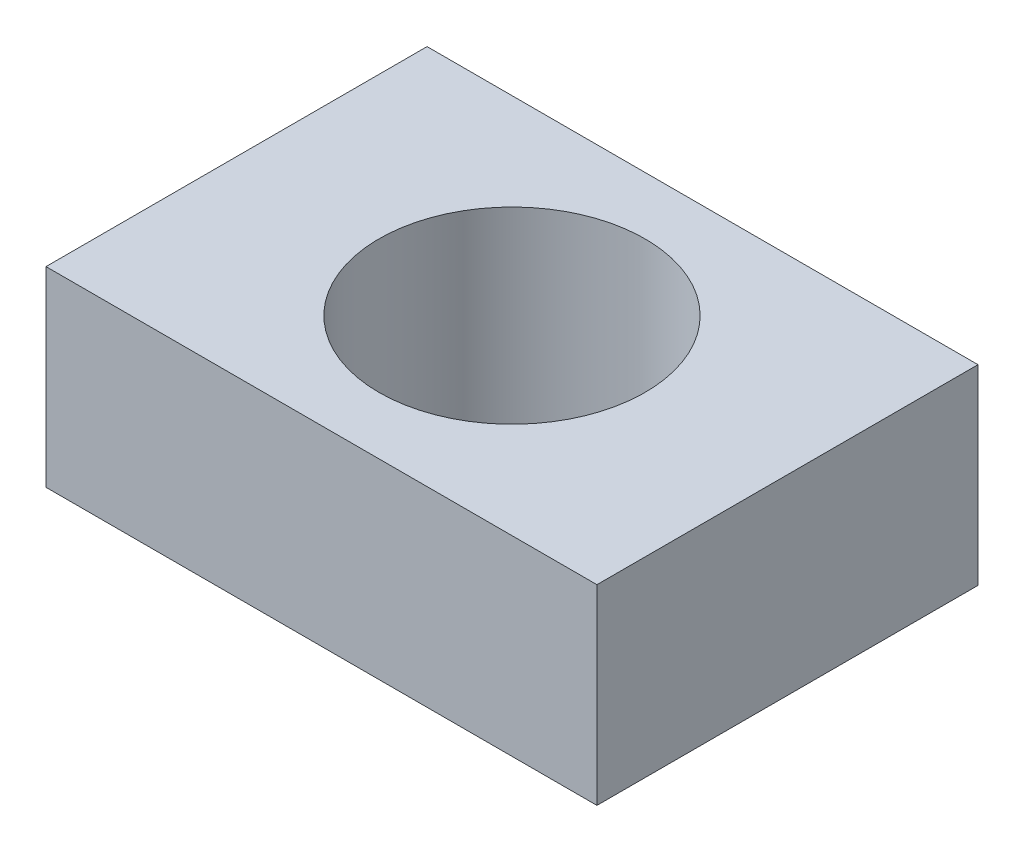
ISO-10303-21;
HEADER;
FILE_DESCRIPTION(('STEP AP214'),'2;1');
FILE_NAME('part.step','',(''),(''),'','','');
FILE_SCHEMA(('AUTOMOTIVE_DESIGN { 1 0 10303 214 1 1 1 1 }'));
ENDSEC;
DATA;
#1=APPLICATION_CONTEXT('core data for automotive mechanical design processes');
#2=APPLICATION_PROTOCOL_DEFINITION('international standard','automotive_design',2000,#1);
#3=PRODUCT_CONTEXT('',#1,'mechanical');
#4=PRODUCT('Part','Part','',(#3));
#5=PRODUCT_RELATED_PRODUCT_CATEGORY('part','',(#4));
#6=PRODUCT_DEFINITION_FORMATION('','',#4);
#7=PRODUCT_DEFINITION_CONTEXT('part definition',#1,'design');
#8=PRODUCT_DEFINITION('design','',#6,#7);
#9=PRODUCT_DEFINITION_SHAPE('','',#8);
#10=(LENGTH_UNIT() NAMED_UNIT(*) SI_UNIT(.MILLI.,.METRE.));
#11=(NAMED_UNIT(*) PLANE_ANGLE_UNIT() SI_UNIT($,.RADIAN.));
#12=(NAMED_UNIT(*) SI_UNIT($,.STERADIAN.) SOLID_ANGLE_UNIT());
#13=UNCERTAINTY_MEASURE_WITH_UNIT(LENGTH_MEASURE(1.E-05),#10,'distance_accuracy_value','');
#14=(GEOMETRIC_REPRESENTATION_CONTEXT(3) GLOBAL_UNCERTAINTY_ASSIGNED_CONTEXT((#13)) GLOBAL_UNIT_ASSIGNED_CONTEXT((#10,
#11,#12)) REPRESENTATION_CONTEXT('',''));
#15=CARTESIAN_POINT('',(0.,0.,0.));
#16=DIRECTION('',(0.,0.,1.));
#17=DIRECTION('',(1.,0.,0.));
#18=AXIS2_PLACEMENT_3D('',#15,#16,#17);
#19=CARTESIAN_POINT('',(0.,58.,0.));
#20=DIRECTION('',(0.,1.,0.));
#21=DIRECTION('',(0.,0.,1.));
#22=AXIS2_PLACEMENT_3D('',#19,#20,#21);
#23=PLANE('',#22);
#24=DIRECTION('',(0.,0.,-1.));
#25=VECTOR('',#24,1.);
#26=CARTESIAN_POINT('',(83.5746487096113,58.,-57.8053965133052));
#27=LINE('',#26,#25);
#28=CARTESIAN_POINT('',(83.5746487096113,58.,57.8053965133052));
#29=VERTEX_POINT('',#28);
#30=CARTESIAN_POINT('',(83.5746487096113,58.,-57.8053965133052));
#31=VERTEX_POINT('',#30);
#32=EDGE_CURVE('E85',#29,#31,#27,.T.);
#33=ORIENTED_EDGE('',*,*,#32,.T.);
#34=DIRECTION('',(-1.,0.,0.));
#35=VECTOR('',#34,1.);
#36=CARTESIAN_POINT('',(-83.5746487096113,58.,-57.8053965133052));
#37=LINE('',#36,#35);
#38=CARTESIAN_POINT('',(-83.5746487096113,58.,-57.8053965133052));
#39=VERTEX_POINT('',#38);
#40=EDGE_CURVE('E80',#31,#39,#37,.T.);
#41=ORIENTED_EDGE('',*,*,#40,.T.);
#42=DIRECTION('',(0.,0.,1.));
#43=VECTOR('',#42,1.);
#44=CARTESIAN_POINT('',(-83.5746487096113,58.,-57.8053965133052));
#45=LINE('',#44,#43);
#46=CARTESIAN_POINT('',(-83.5746487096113,58.,57.8053965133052));
#47=VERTEX_POINT('',#46);
#48=EDGE_CURVE('E83',#39,#47,#45,.T.);
#49=ORIENTED_EDGE('',*,*,#48,.T.);
#50=DIRECTION('',(1.,0.,0.));
#51=VECTOR('',#50,1.);
#52=CARTESIAN_POINT('',(-83.5746487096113,58.,57.8053965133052));
#53=LINE('',#52,#51);
#54=EDGE_CURVE('E50',#47,#29,#53,.T.);
#55=ORIENTED_EDGE('',*,*,#54,.T.);
#56=EDGE_LOOP('',(#33,#41,#49,#55));
#57=FACE_BOUND('',#56,.T.);
#58=CARTESIAN_POINT('',(0.,58.,0.));
#59=DIRECTION('',(0.,1.,0.));
#60=DIRECTION('',(0.,0.,1.));
#61=AXIS2_PLACEMENT_3D('',#58,#59,#60);
#62=CIRCLE('',#61,40.3658481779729);
#63=CARTESIAN_POINT('',(0.,58.,40.3658481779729));
#64=VERTEX_POINT('',#63);
#65=EDGE_CURVE('E100',#64,#64,#62,.T.);
#66=ORIENTED_EDGE('',*,*,#65,.F.);
#67=EDGE_LOOP('',(#66));
#68=FACE_BOUND('',#67,.T.);
#69=ADVANCED_FACE('F33',(#57,#68),#23,.T.);
#70=CARTESIAN_POINT('',(0.,0.,0.));
#71=DIRECTION('',(0.,1.,0.));
#72=DIRECTION('',(0.,0.,1.));
#73=AXIS2_PLACEMENT_3D('',#70,#71,#72);
#74=PLANE('',#73);
#75=DIRECTION('',(0.,0.,-1.));
#76=VECTOR('',#75,1.);
#77=CARTESIAN_POINT('',(83.5746487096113,0.,-57.8053965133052));
#78=LINE('',#77,#76);
#79=CARTESIAN_POINT('',(83.5746487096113,0.,57.8053965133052));
#80=VERTEX_POINT('',#79);
#81=CARTESIAN_POINT('',(83.5746487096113,0.,-57.8053965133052));
#82=VERTEX_POINT('',#81);
#83=EDGE_CURVE('E97',#80,#82,#78,.T.);
#84=ORIENTED_EDGE('',*,*,#83,.F.);
#85=DIRECTION('',(1.,0.,0.));
#86=VECTOR('',#85,1.);
#87=CARTESIAN_POINT('',(-83.5746487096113,0.,57.8053965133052));
#88=LINE('',#87,#86);
#89=CARTESIAN_POINT('',(-83.5746487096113,0.,57.8053965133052));
#90=VERTEX_POINT('',#89);
#91=EDGE_CURVE('E73',#90,#80,#88,.T.);
#92=ORIENTED_EDGE('',*,*,#91,.F.);
#93=DIRECTION('',(0.,0.,1.));
#94=VECTOR('',#93,1.);
#95=CARTESIAN_POINT('',(-83.5746487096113,0.,-57.8053965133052));
#96=LINE('',#95,#94);
#97=CARTESIAN_POINT('',(-83.5746487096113,0.,-57.8053965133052));
#98=VERTEX_POINT('',#97);
#99=EDGE_CURVE('E67',#98,#90,#96,.T.);
#100=ORIENTED_EDGE('',*,*,#99,.F.);
#101=DIRECTION('',(-1.,0.,0.));
#102=VECTOR('',#101,1.);
#103=CARTESIAN_POINT('',(-83.5746487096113,0.,-57.8053965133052));
#104=LINE('',#103,#102);
#105=EDGE_CURVE('E89',#82,#98,#104,.T.);
#106=ORIENTED_EDGE('',*,*,#105,.F.);
#107=EDGE_LOOP('',(#84,#92,#100,#106));
#108=FACE_BOUND('',#107,.T.);
#109=CARTESIAN_POINT('',(0.,0.,0.));
#110=DIRECTION('',(0.,1.,0.));
#111=DIRECTION('',(0.,0.,1.));
#112=AXIS2_PLACEMENT_3D('',#109,#110,#111);
#113=CIRCLE('',#112,40.3658481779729);
#114=CARTESIAN_POINT('',(0.,0.,40.3658481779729));
#115=VERTEX_POINT('',#114);
#116=EDGE_CURVE('E112',#115,#115,#113,.T.);
#117=ORIENTED_EDGE('',*,*,#116,.T.);
#118=EDGE_LOOP('',(#117));
#119=FACE_BOUND('',#118,.T.);
#120=ADVANCED_FACE('F108',(#108,#119),#74,.F.);
#121=CARTESIAN_POINT('',(83.5746487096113,58.,-57.8053965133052));
#122=DIRECTION('',(-1.,0.,0.));
#123=DIRECTION('',(0.,0.,1.));
#124=AXIS2_PLACEMENT_3D('',#121,#122,#123);
#125=PLANE('',#124);
#126=ORIENTED_EDGE('',*,*,#83,.T.);
#127=DIRECTION('',(0.,-1.,0.));
#128=VECTOR('',#127,1.);
#129=CARTESIAN_POINT('',(83.5746487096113,58.,-57.8053965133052));
#130=LINE('',#129,#128);
#131=EDGE_CURVE('E11',#31,#82,#130,.T.);
#132=ORIENTED_EDGE('',*,*,#131,.F.);
#133=ORIENTED_EDGE('',*,*,#32,.F.);
#134=DIRECTION('',(0.,-1.,0.));
#135=VECTOR('',#134,1.);
#136=CARTESIAN_POINT('',(83.5746487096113,58.,57.8053965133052));
#137=LINE('',#136,#135);
#138=EDGE_CURVE('E93',#29,#80,#137,.T.);
#139=ORIENTED_EDGE('',*,*,#138,.T.);
#140=EDGE_LOOP('',(#126,#132,#133,#139));
#141=FACE_BOUND('',#140,.T.);
#142=ADVANCED_FACE('F35',(#141),#125,.F.);
#143=CARTESIAN_POINT('',(-83.5746487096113,58.,-57.8053965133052));
#144=DIRECTION('',(0.,0.,1.));
#145=DIRECTION('',(1.,0.,0.));
#146=AXIS2_PLACEMENT_3D('',#143,#144,#145);
#147=PLANE('',#146);
#148=ORIENTED_EDGE('',*,*,#105,.T.);
#149=DIRECTION('',(0.,-1.,0.));
#150=VECTOR('',#149,1.);
#151=CARTESIAN_POINT('',(-83.5746487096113,58.,-57.8053965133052));
#152=LINE('',#151,#150);
#153=EDGE_CURVE('E42',#39,#98,#152,.T.);
#154=ORIENTED_EDGE('',*,*,#153,.F.);
#155=ORIENTED_EDGE('',*,*,#40,.F.);
#156=ORIENTED_EDGE('',*,*,#131,.T.);
#157=EDGE_LOOP('',(#148,#154,#155,#156));
#158=FACE_BOUND('',#157,.T.);
#159=ADVANCED_FACE('F88',(#158),#147,.F.);
#160=CARTESIAN_POINT('',(-83.5746487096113,58.,-57.8053965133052));
#161=DIRECTION('',(1.,0.,0.));
#162=DIRECTION('',(0.,0.,-1.));
#163=AXIS2_PLACEMENT_3D('',#160,#161,#162);
#164=PLANE('',#163);
#165=ORIENTED_EDGE('',*,*,#99,.T.);
#166=DIRECTION('',(0.,-1.,0.));
#167=VECTOR('',#166,1.);
#168=CARTESIAN_POINT('',(-83.5746487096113,58.,57.8053965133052));
#169=LINE('',#168,#167);
#170=EDGE_CURVE('E90',#47,#90,#169,.T.);
#171=ORIENTED_EDGE('',*,*,#170,.F.);
#172=ORIENTED_EDGE('',*,*,#48,.F.);
#173=ORIENTED_EDGE('',*,*,#153,.T.);
#174=EDGE_LOOP('',(#165,#171,#172,#173));
#175=FACE_BOUND('',#174,.T.);
#176=ADVANCED_FACE('F91',(#175),#164,.F.);
#177=CARTESIAN_POINT('',(-83.5746487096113,58.,57.8053965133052));
#178=DIRECTION('',(0.,0.,-1.));
#179=DIRECTION('',(-1.,0.,0.));
#180=AXIS2_PLACEMENT_3D('',#177,#178,#179);
#181=PLANE('',#180);
#182=ORIENTED_EDGE('',*,*,#91,.T.);
#183=ORIENTED_EDGE('',*,*,#138,.F.);
#184=ORIENTED_EDGE('',*,*,#54,.F.);
#185=ORIENTED_EDGE('',*,*,#170,.T.);
#186=EDGE_LOOP('',(#182,#183,#184,#185));
#187=FACE_BOUND('',#186,.T.);
#188=ADVANCED_FACE('F105',(#187),#181,.F.);
#189=CARTESIAN_POINT('',(0.,58.,0.));
#190=DIRECTION('',(0.,-1.,0.));
#191=DIRECTION('',(0.,0.,-1.));
#192=AXIS2_PLACEMENT_3D('',#189,#190,#191);
#193=CYLINDRICAL_SURFACE('',#192,40.3658481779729);
#194=ORIENTED_EDGE('',*,*,#65,.T.);
#195=EDGE_LOOP('',(#194));
#196=FACE_BOUND('',#195,.T.);
#197=ORIENTED_EDGE('',*,*,#116,.F.);
#198=EDGE_LOOP('',(#197));
#199=FACE_BOUND('',#198,.T.);
#200=ADVANCED_FACE('F118',(#196,#199),#193,.F.);
#201=CLOSED_SHELL('',(#69,#120,#142,#159,#176,#188,#200));
#202=MANIFOLD_SOLID_BREP('B2',#201);
#203=ADVANCED_BREP_SHAPE_REPRESENTATION('',(#18,#202),#14);
#204=SHAPE_DEFINITION_REPRESENTATION(#9,#203);
ENDSEC;
END-ISO-10303-21;
